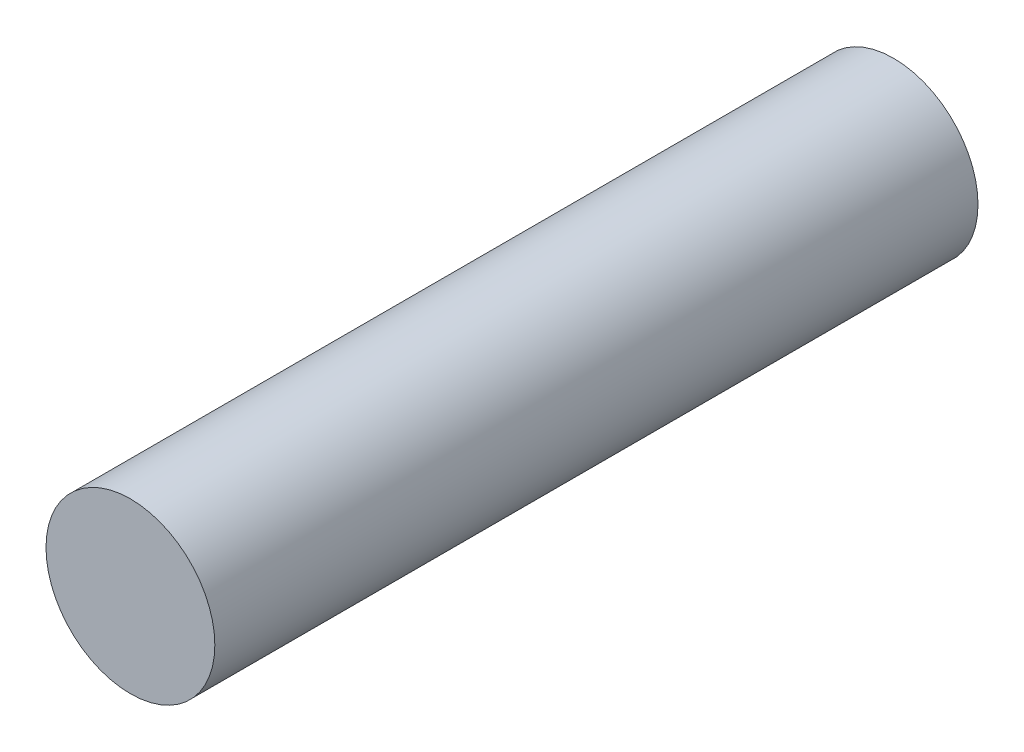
ISO-10303-21;
HEADER;
FILE_DESCRIPTION(('STEP AP214'),'2;1');
FILE_NAME('part.step','',(''),(''),'','','');
FILE_SCHEMA(('AUTOMOTIVE_DESIGN { 1 0 10303 214 1 1 1 1 }'));
ENDSEC;
DATA;
#1=APPLICATION_CONTEXT('core data for automotive mechanical design processes');
#2=APPLICATION_PROTOCOL_DEFINITION('international standard','automotive_design',2000,#1);
#3=PRODUCT_CONTEXT('',#1,'mechanical');
#4=PRODUCT('Part','Part','',(#3));
#5=PRODUCT_RELATED_PRODUCT_CATEGORY('part','',(#4));
#6=PRODUCT_DEFINITION_FORMATION('','',#4);
#7=PRODUCT_DEFINITION_CONTEXT('part definition',#1,'design');
#8=PRODUCT_DEFINITION('design','',#6,#7);
#9=PRODUCT_DEFINITION_SHAPE('','',#8);
#10=(LENGTH_UNIT() NAMED_UNIT(*) SI_UNIT(.MILLI.,.METRE.));
#11=(NAMED_UNIT(*) PLANE_ANGLE_UNIT() SI_UNIT($,.RADIAN.));
#12=(NAMED_UNIT(*) SI_UNIT($,.STERADIAN.) SOLID_ANGLE_UNIT());
#13=UNCERTAINTY_MEASURE_WITH_UNIT(LENGTH_MEASURE(1.E-05),#10,'distance_accuracy_value','');
#14=(GEOMETRIC_REPRESENTATION_CONTEXT(3) GLOBAL_UNCERTAINTY_ASSIGNED_CONTEXT((#13)) GLOBAL_UNIT_ASSIGNED_CONTEXT((#10,
#11,#12)) REPRESENTATION_CONTEXT('',''));
#15=CARTESIAN_POINT('',(0.,0.,0.));
#16=DIRECTION('',(0.,0.,1.));
#17=DIRECTION('',(1.,0.,0.));
#18=AXIS2_PLACEMENT_3D('',#15,#16,#17);
#19=CARTESIAN_POINT('',(0.,0.,86.106));
#20=DIRECTION('',(0.,0.,-1.));
#21=DIRECTION('',(-1.,0.,0.));
#22=AXIS2_PLACEMENT_3D('',#19,#20,#21);
#23=CYLINDRICAL_SURFACE('',#22,9.525);
#24=CARTESIAN_POINT('',(0.,0.,86.106));
#25=DIRECTION('',(0.,0.,1.));
#26=DIRECTION('',(1.,0.,0.));
#27=AXIS2_PLACEMENT_3D('',#24,#25,#26);
#28=CIRCLE('',#27,9.525);
#29=CARTESIAN_POINT('',(9.525,0.,86.106));
#30=VERTEX_POINT('',#29);
#31=EDGE_CURVE('E10',#30,#30,#28,.T.);
#32=ORIENTED_EDGE('',*,*,#31,.F.);
#33=EDGE_LOOP('',(#32));
#34=FACE_BOUND('',#33,.T.);
#35=CARTESIAN_POINT('',(0.,0.,0.));
#36=DIRECTION('',(0.,0.,1.));
#37=DIRECTION('',(1.,0.,0.));
#38=AXIS2_PLACEMENT_3D('',#35,#36,#37);
#39=CIRCLE('',#38,9.525);
#40=CARTESIAN_POINT('',(9.525,0.,0.));
#41=VERTEX_POINT('',#40);
#42=EDGE_CURVE('E32',#41,#41,#39,.T.);
#43=ORIENTED_EDGE('',*,*,#42,.T.);
#44=EDGE_LOOP('',(#43));
#45=FACE_BOUND('',#44,.T.);
#46=ADVANCED_FACE('F29',(#34,#45),#23,.T.);
#47=CARTESIAN_POINT('',(0.,0.,86.106));
#48=DIRECTION('',(0.,0.,1.));
#49=DIRECTION('',(1.,0.,0.));
#50=AXIS2_PLACEMENT_3D('',#47,#48,#49);
#51=PLANE('',#50);
#52=ORIENTED_EDGE('',*,*,#31,.T.);
#53=EDGE_LOOP('',(#52));
#54=FACE_BOUND('',#53,.T.);
#55=ADVANCED_FACE('F44',(#54),#51,.T.);
#56=CARTESIAN_POINT('',(0.,0.,0.));
#57=DIRECTION('',(0.,0.,1.));
#58=DIRECTION('',(1.,0.,0.));
#59=AXIS2_PLACEMENT_3D('',#56,#57,#58);
#60=PLANE('',#59);
#61=ORIENTED_EDGE('',*,*,#42,.F.);
#62=EDGE_LOOP('',(#61));
#63=FACE_BOUND('',#62,.T.);
#64=ADVANCED_FACE('F42',(#63),#60,.F.);
#65=CLOSED_SHELL('',(#46,#55,#64));
#66=MANIFOLD_SOLID_BREP('B2',#65);
#67=ADVANCED_BREP_SHAPE_REPRESENTATION('',(#18,#66),#14);
#68=SHAPE_DEFINITION_REPRESENTATION(#9,#67);
ENDSEC;
END-ISO-10303-21;
